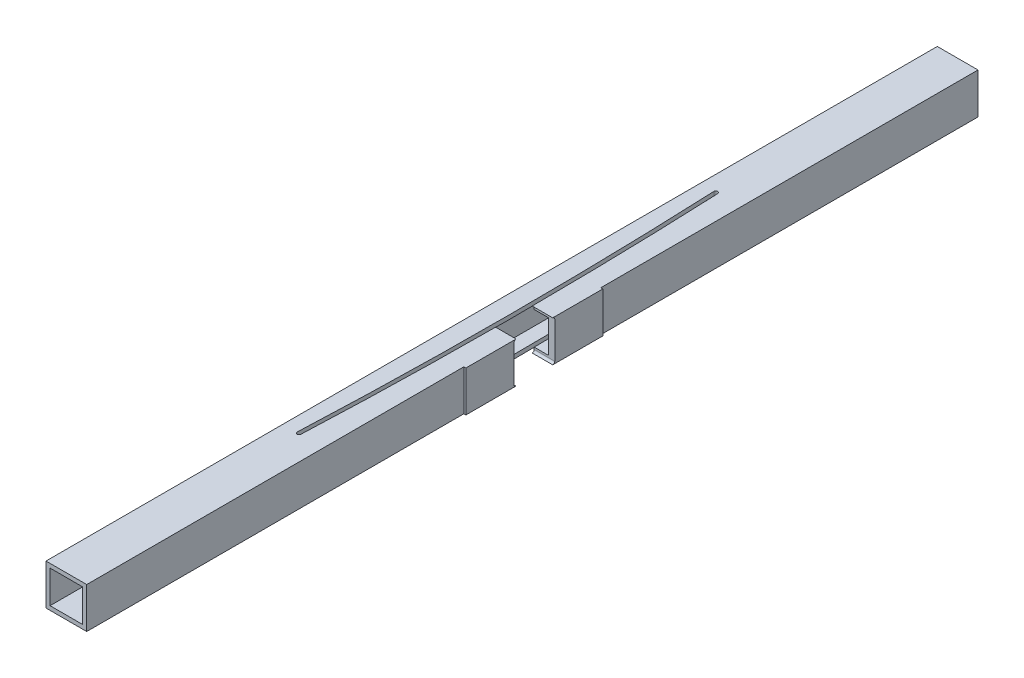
ISO-10303-21;
HEADER;
FILE_DESCRIPTION(('STEP AP214'),'2;1');
FILE_NAME('part.step','',(''),(''),'','','');
FILE_SCHEMA(('AUTOMOTIVE_DESIGN { 1 0 10303 214 1 1 1 1 }'));
ENDSEC;
DATA;
#1=APPLICATION_CONTEXT('core data for automotive mechanical design processes');
#2=APPLICATION_PROTOCOL_DEFINITION('international standard','automotive_design',2000,#1);
#3=PRODUCT_CONTEXT('',#1,'mechanical');
#4=PRODUCT('Part','Part','',(#3));
#5=PRODUCT_RELATED_PRODUCT_CATEGORY('part','',(#4));
#6=PRODUCT_DEFINITION_FORMATION('','',#4);
#7=PRODUCT_DEFINITION_CONTEXT('part definition',#1,'design');
#8=PRODUCT_DEFINITION('design','',#6,#7);
#9=PRODUCT_DEFINITION_SHAPE('','',#8);
#10=(LENGTH_UNIT() NAMED_UNIT(*) SI_UNIT(.MILLI.,.METRE.));
#11=(NAMED_UNIT(*) PLANE_ANGLE_UNIT() SI_UNIT($,.RADIAN.));
#12=(NAMED_UNIT(*) SI_UNIT($,.STERADIAN.) SOLID_ANGLE_UNIT());
#13=UNCERTAINTY_MEASURE_WITH_UNIT(LENGTH_MEASURE(1.E-05),#10,'distance_accuracy_value','');
#14=(GEOMETRIC_REPRESENTATION_CONTEXT(3) GLOBAL_UNCERTAINTY_ASSIGNED_CONTEXT((#13)) GLOBAL_UNIT_ASSIGNED_CONTEXT((#10,
#11,#12)) REPRESENTATION_CONTEXT('',''));
#15=CARTESIAN_POINT('',(0.,0.,0.));
#16=DIRECTION('',(0.,0.,1.));
#17=DIRECTION('',(1.,0.,0.));
#18=AXIS2_PLACEMENT_3D('',#15,#16,#17);
#19=CARTESIAN_POINT('',(31.75,-31.75,695.));
#20=DIRECTION('',(-1.,0.,0.));
#21=DIRECTION('',(0.,-1.,0.));
#22=AXIS2_PLACEMENT_3D('',#19,#20,#21);
#23=PLANE('',#22);
#24=DIRECTION('',(0.,-1.,0.));
#25=VECTOR('',#24,1.);
#26=CARTESIAN_POINT('',(31.75,-31.75,106.75));
#27=LINE('',#26,#25);
#28=CARTESIAN_POINT('',(31.75,31.75,106.75));
#29=VERTEX_POINT('',#28);
#30=CARTESIAN_POINT('',(31.75,-31.75,106.75));
#31=VERTEX_POINT('',#30);
#32=EDGE_CURVE('E72',#29,#31,#27,.T.);
#33=ORIENTED_EDGE('',*,*,#32,.F.);
#34=DIRECTION('',(0.,0.,-1.));
#35=VECTOR('',#34,1.);
#36=CARTESIAN_POINT('',(31.75,31.75,695.));
#37=LINE('',#36,#35);
#38=CARTESIAN_POINT('',(31.75,31.75,695.));
#39=VERTEX_POINT('',#38);
#40=EDGE_CURVE('E460',#39,#29,#37,.T.);
#41=ORIENTED_EDGE('',*,*,#40,.F.);
#42=DIRECTION('',(0.,1.,0.));
#43=VECTOR('',#42,1.);
#44=CARTESIAN_POINT('',(31.75,-31.75,695.));
#45=LINE('',#44,#43);
#46=CARTESIAN_POINT('',(31.75,-31.75,695.));
#47=VERTEX_POINT('',#46);
#48=EDGE_CURVE('E557',#47,#39,#45,.T.);
#49=ORIENTED_EDGE('',*,*,#48,.F.);
#50=DIRECTION('',(0.,0.,-1.));
#51=VECTOR('',#50,1.);
#52=CARTESIAN_POINT('',(31.75,-31.75,695.));
#53=LINE('',#52,#51);
#54=EDGE_CURVE('E573',#47,#31,#53,.T.);
#55=ORIENTED_EDGE('',*,*,#54,.T.);
#56=EDGE_LOOP('',(#33,#41,#49,#55));
#57=FACE_BOUND('',#56,.T.);
#58=ADVANCED_FACE('F58',(#57),#23,.F.);
#59=CARTESIAN_POINT('',(31.75,31.75,-106.75));
#60=VERTEX_POINT('',#59);
#61=CARTESIAN_POINT('',(31.75,31.75,-695.));
#62=VERTEX_POINT('',#61);
#63=EDGE_CURVE('E455',#60,#62,#37,.T.);
#64=ORIENTED_EDGE('',*,*,#63,.F.);
#65=DIRECTION('',(0.,-1.,0.));
#66=VECTOR('',#65,1.);
#67=CARTESIAN_POINT('',(31.75,-31.75,-106.75));
#68=LINE('',#67,#66);
#69=CARTESIAN_POINT('',(31.75,-31.75,-106.75));
#70=VERTEX_POINT('',#69);
#71=EDGE_CURVE('E278',#60,#70,#68,.T.);
#72=ORIENTED_EDGE('',*,*,#71,.T.);
#73=CARTESIAN_POINT('',(31.75,-31.75,-695.));
#74=VERTEX_POINT('',#73);
#75=EDGE_CURVE('E274',#70,#74,#53,.T.);
#76=ORIENTED_EDGE('',*,*,#75,.T.);
#77=DIRECTION('',(0.,1.,0.));
#78=VECTOR('',#77,1.);
#79=CARTESIAN_POINT('',(31.75,-31.75,-695.));
#80=LINE('',#79,#78);
#81=EDGE_CURVE('E457',#74,#62,#80,.T.);
#82=ORIENTED_EDGE('',*,*,#81,.T.);
#83=EDGE_LOOP('',(#64,#72,#76,#82));
#84=FACE_BOUND('',#83,.T.);
#85=ADVANCED_FACE('F442',(#84),#23,.F.);
#86=CARTESIAN_POINT('',(-31.75,-31.75,695.));
#87=DIRECTION('',(0.,1.,0.));
#88=DIRECTION('',(0.,0.,1.));
#89=AXIS2_PLACEMENT_3D('',#86,#87,#88);
#90=PLANE('',#89);
#91=CARTESIAN_POINT('',(19.925,-31.75,50.));
#92=DIRECTION('',(0.,-1.,0.));
#93=DIRECTION('',(0.,0.,-1.));
#94=AXIS2_PLACEMENT_3D('',#91,#92,#93);
#95=CIRCLE('',#94,3.175);
#96=CARTESIAN_POINT('',(19.925,-31.75,46.825));
#97=VERTEX_POINT('',#96);
#98=EDGE_CURVE('E1006',#97,#97,#95,.T.);
#99=ORIENTED_EDGE('',*,*,#98,.F.);
#100=EDGE_LOOP('',(#99));
#101=FACE_BOUND('',#100,.T.);
#102=ORIENTED_EDGE('',*,*,#75,.F.);
#103=DIRECTION('',(-1.,0.,0.));
#104=VECTOR('',#103,1.);
#105=CARTESIAN_POINT('',(34.925,-31.75,-106.75));
#106=LINE('',#105,#104);
#107=CARTESIAN_POINT('',(34.925,-31.75,-106.75));
#108=VERTEX_POINT('',#107);
#109=EDGE_CURVE('E267',#108,#70,#106,.T.);
#110=ORIENTED_EDGE('',*,*,#109,.F.);
#111=DIRECTION('',(0.,0.,1.));
#112=VECTOR('',#111,1.);
#113=CARTESIAN_POINT('',(34.925,-31.75,-28.575));
#114=LINE('',#113,#112);
#115=CARTESIAN_POINT('',(34.925,-31.75,-28.575));
#116=VERTEX_POINT('',#115);
#117=EDGE_CURVE('E271',#108,#116,#114,.T.);
#118=ORIENTED_EDGE('',*,*,#117,.T.);
#119=DIRECTION('',(1.,0.,0.));
#120=VECTOR('',#119,1.);
#121=CARTESIAN_POINT('',(0.800000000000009,-31.75,-28.575));
#122=LINE('',#121,#120);
#123=CARTESIAN_POINT('',(2.94439046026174,-31.7500000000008,-28.575));
#124=VERTEX_POINT('',#123);
#125=EDGE_CURVE('E499',#124,#116,#122,.T.);
#126=ORIENTED_EDGE('',*,*,#125,.F.);
#127=CARTESIAN_POINT('',(-7338.66944444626,-31.75,0.));
#128=DIRECTION('',(0.,1.,0.));
#129=DIRECTION('',(0.,0.,1.));
#130=AXIS2_PLACEMENT_3D('',#127,#128,#129);
#131=CIRCLE('',#130,7341.66944444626);
#132=CARTESIAN_POINT('',(-4.20294331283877,-31.75,-325.132857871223));
#133=VERTEX_POINT('',#132);
#134=EDGE_CURVE('E346',#124,#133,#131,.T.);
#135=ORIENTED_EDGE('',*,*,#134,.T.);
#136=CARTESIAN_POINT('',(-7.19999999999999,-31.75,-325.));
#137=DIRECTION('',(0.,1.,0.));
#138=DIRECTION('',(0.,0.,1.));
#139=AXIS2_PLACEMENT_3D('',#136,#137,#138);
#140=CIRCLE('',#139,3.00000000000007);
#141=CARTESIAN_POINT('',(-10.1970566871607,-31.75,-324.867142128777));
#142=VERTEX_POINT('',#141);
#143=EDGE_CURVE('E350',#133,#142,#140,.T.);
#144=ORIENTED_EDGE('',*,*,#143,.T.);
#145=CARTESIAN_POINT('',(-7338.66944444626,-31.75,0.));
#146=DIRECTION('',(0.,-1.,0.));
#147=DIRECTION('',(0.,0.,1.));
#148=AXIS2_PLACEMENT_3D('',#145,#146,#147);
#149=CIRCLE('',#148,7335.66944444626);
#150=CARTESIAN_POINT('',(-10.1970566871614,-31.75,324.867142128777));
#151=VERTEX_POINT('',#150);
#152=EDGE_CURVE('E353',#142,#151,#149,.T.);
#153=ORIENTED_EDGE('',*,*,#152,.T.);
#154=CARTESIAN_POINT('',(-7.19999999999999,-31.75,325.));
#155=DIRECTION('',(0.,1.,0.));
#156=DIRECTION('',(0.,0.,1.));
#157=AXIS2_PLACEMENT_3D('',#154,#155,#156);
#158=CIRCLE('',#157,3.00000000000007);
#159=CARTESIAN_POINT('',(-4.20294331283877,-31.75,325.132857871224));
#160=VERTEX_POINT('',#159);
#161=EDGE_CURVE('E343',#151,#160,#158,.T.);
#162=ORIENTED_EDGE('',*,*,#161,.T.);
#163=CARTESIAN_POINT('',(2.94439046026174,-31.7500000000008,28.575));
#164=VERTEX_POINT('',#163);
#165=EDGE_CURVE('E347',#160,#164,#131,.T.);
#166=ORIENTED_EDGE('',*,*,#165,.T.);
#167=DIRECTION('',(1.,0.,0.));
#168=VECTOR('',#167,1.);
#169=CARTESIAN_POINT('',(0.800000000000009,-31.75,28.575));
#170=LINE('',#169,#168);
#171=CARTESIAN_POINT('',(34.925,-31.75,28.575));
#172=VERTEX_POINT('',#171);
#173=EDGE_CURVE('E503',#164,#172,#170,.T.);
#174=ORIENTED_EDGE('',*,*,#173,.T.);
#175=DIRECTION('',(0.,0.,-1.));
#176=VECTOR('',#175,1.);
#177=CARTESIAN_POINT('',(34.925,-31.75,28.575));
#178=LINE('',#177,#176);
#179=CARTESIAN_POINT('',(34.925,-31.75,106.75));
#180=VERTEX_POINT('',#179);
#181=EDGE_CURVE('E308',#180,#172,#178,.T.);
#182=ORIENTED_EDGE('',*,*,#181,.F.);
#183=DIRECTION('',(-1.,0.,0.));
#184=VECTOR('',#183,1.);
#185=CARTESIAN_POINT('',(34.925,-31.75,106.75));
#186=LINE('',#185,#184);
#187=EDGE_CURVE('E324',#180,#31,#186,.T.);
#188=ORIENTED_EDGE('',*,*,#187,.T.);
#189=ORIENTED_EDGE('',*,*,#54,.F.);
#190=DIRECTION('',(1.,0.,0.));
#191=VECTOR('',#190,1.);
#192=CARTESIAN_POINT('',(-31.75,-31.75,695.));
#193=LINE('',#192,#191);
#194=CARTESIAN_POINT('',(-31.75,-31.75,695.));
#195=VERTEX_POINT('',#194);
#196=EDGE_CURVE('E565',#195,#47,#193,.T.);
#197=ORIENTED_EDGE('',*,*,#196,.F.);
#198=DIRECTION('',(0.,0.,-1.));
#199=VECTOR('',#198,1.);
#200=CARTESIAN_POINT('',(-31.75,-31.75,695.));
#201=LINE('',#200,#199);
#202=CARTESIAN_POINT('',(-31.75,-31.75,-695.));
#203=VERTEX_POINT('',#202);
#204=EDGE_CURVE('E465',#195,#203,#201,.T.);
#205=ORIENTED_EDGE('',*,*,#204,.T.);
#206=DIRECTION('',(1.,0.,0.));
#207=VECTOR('',#206,1.);
#208=CARTESIAN_POINT('',(-31.75,-31.75,-695.));
#209=LINE('',#208,#207);
#210=EDGE_CURVE('E561',#203,#74,#209,.T.);
#211=ORIENTED_EDGE('',*,*,#210,.T.);
#212=EDGE_LOOP('',(#102,#110,#118,#126,#135,#144,#153,#162,#166,#174,#182,#188,#189,#197,#205,#211));
#213=FACE_BOUND('',#212,.T.);
#214=ADVANCED_FACE('F269',(#101,#213),#90,.F.);
#215=CARTESIAN_POINT('',(25.4,-25.4,695.));
#216=DIRECTION('',(-1.,0.,0.));
#217=DIRECTION('',(0.,0.,1.));
#218=AXIS2_PLACEMENT_3D('',#215,#216,#217);
#219=PLANE('',#218);
#220=DIRECTION('',(0.,-1.,0.));
#221=VECTOR('',#220,1.);
#222=CARTESIAN_POINT('',(25.4,-25.4,-31.7500000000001));
#223=LINE('',#222,#221);
#224=CARTESIAN_POINT('',(25.4,25.4,-31.7500000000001));
#225=VERTEX_POINT('',#224);
#226=CARTESIAN_POINT('',(25.4,-25.4,-31.7500000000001));
#227=VERTEX_POINT('',#226);
#228=EDGE_CURVE('E521',#225,#227,#223,.T.);
#229=ORIENTED_EDGE('',*,*,#228,.F.);
#230=DIRECTION('',(0.,0.,-1.));
#231=VECTOR('',#230,1.);
#232=CARTESIAN_POINT('',(25.4,25.4,695.));
#233=LINE('',#232,#231);
#234=CARTESIAN_POINT('',(25.4,25.4,-695.));
#235=VERTEX_POINT('',#234);
#236=EDGE_CURVE('E553',#225,#235,#233,.T.);
#237=ORIENTED_EDGE('',*,*,#236,.T.);
#238=DIRECTION('',(0.,1.,0.));
#239=VECTOR('',#238,1.);
#240=CARTESIAN_POINT('',(25.4,-25.4,-695.));
#241=LINE('',#240,#239);
#242=CARTESIAN_POINT('',(25.4,-25.4,-695.));
#243=VERTEX_POINT('',#242);
#244=EDGE_CURVE('E525',#243,#235,#241,.T.);
#245=ORIENTED_EDGE('',*,*,#244,.F.);
#246=DIRECTION('',(0.,0.,-1.));
#247=VECTOR('',#246,1.);
#248=CARTESIAN_POINT('',(25.4,-25.4,695.));
#249=LINE('',#248,#247);
#250=EDGE_CURVE('E536',#227,#243,#249,.T.);
#251=ORIENTED_EDGE('',*,*,#250,.F.);
#252=EDGE_LOOP('',(#229,#237,#245,#251));
#253=FACE_BOUND('',#252,.T.);
#254=ADVANCED_FACE('F450',(#253),#219,.T.);
#255=CARTESIAN_POINT('',(0.,0.,695.));
#256=DIRECTION('',(0.,0.,-1.));
#257=DIRECTION('',(-1.,0.,0.));
#258=AXIS2_PLACEMENT_3D('',#255,#256,#257);
#259=PLANE('',#258);
#260=ORIENTED_EDGE('',*,*,#48,.T.);
#261=DIRECTION('',(-1.,0.,0.));
#262=VECTOR('',#261,1.);
#263=CARTESIAN_POINT('',(-31.75,31.75,695.));
#264=LINE('',#263,#262);
#265=CARTESIAN_POINT('',(-31.75,31.75,695.));
#266=VERTEX_POINT('',#265);
#267=EDGE_CURVE('E560',#39,#266,#264,.T.);
#268=ORIENTED_EDGE('',*,*,#267,.T.);
#269=DIRECTION('',(0.,-1.,0.));
#270=VECTOR('',#269,1.);
#271=CARTESIAN_POINT('',(-31.75,-31.75,695.));
#272=LINE('',#271,#270);
#273=EDGE_CURVE('E563',#266,#195,#272,.T.);
#274=ORIENTED_EDGE('',*,*,#273,.T.);
#275=ORIENTED_EDGE('',*,*,#196,.T.);
#276=EDGE_LOOP('',(#260,#268,#274,#275));
#277=FACE_BOUND('',#276,.T.);
#278=DIRECTION('',(0.,1.,0.));
#279=VECTOR('',#278,1.);
#280=CARTESIAN_POINT('',(25.4,-25.4,695.));
#281=LINE('',#280,#279);
#282=CARTESIAN_POINT('',(25.4,-25.4,695.));
#283=VERTEX_POINT('',#282);
#284=CARTESIAN_POINT('',(25.4,25.4,695.));
#285=VERTEX_POINT('',#284);
#286=EDGE_CURVE('E526',#283,#285,#281,.T.);
#287=ORIENTED_EDGE('',*,*,#286,.F.);
#288=DIRECTION('',(1.,0.,0.));
#289=VECTOR('',#288,1.);
#290=CARTESIAN_POINT('',(-25.4,-25.4,695.));
#291=LINE('',#290,#289);
#292=CARTESIAN_POINT('',(-25.4,-25.4,695.));
#293=VERTEX_POINT('',#292);
#294=EDGE_CURVE('E534',#293,#283,#291,.T.);
#295=ORIENTED_EDGE('',*,*,#294,.F.);
#296=DIRECTION('',(0.,-1.,0.));
#297=VECTOR('',#296,1.);
#298=CARTESIAN_POINT('',(-25.4,-25.4,695.));
#299=LINE('',#298,#297);
#300=CARTESIAN_POINT('',(-25.4,25.4,695.));
#301=VERTEX_POINT('',#300);
#302=EDGE_CURVE('E531',#301,#293,#299,.T.);
#303=ORIENTED_EDGE('',*,*,#302,.F.);
#304=DIRECTION('',(-1.,0.,0.));
#305=VECTOR('',#304,1.);
#306=CARTESIAN_POINT('',(-25.4,25.4,695.));
#307=LINE('',#306,#305);
#308=EDGE_CURVE('E528',#285,#301,#307,.T.);
#309=ORIENTED_EDGE('',*,*,#308,.F.);
#310=EDGE_LOOP('',(#287,#295,#303,#309));
#311=FACE_BOUND('',#310,.T.);
#312=ADVANCED_FACE('F589',(#277,#311),#259,.F.);
#313=CARTESIAN_POINT('',(0.,0.,-695.));
#314=DIRECTION('',(0.,0.,-1.));
#315=DIRECTION('',(-1.,0.,0.));
#316=AXIS2_PLACEMENT_3D('',#313,#314,#315);
#317=PLANE('',#316);
#318=ORIENTED_EDGE('',*,*,#81,.F.);
#319=ORIENTED_EDGE('',*,*,#210,.F.);
#320=DIRECTION('',(0.,-1.,0.));
#321=VECTOR('',#320,1.);
#322=CARTESIAN_POINT('',(-31.75,-31.75,-695.));
#323=LINE('',#322,#321);
#324=CARTESIAN_POINT('',(-31.75,31.75,-695.));
#325=VERTEX_POINT('',#324);
#326=EDGE_CURVE('E570',#325,#203,#323,.T.);
#327=ORIENTED_EDGE('',*,*,#326,.F.);
#328=DIRECTION('',(-1.,0.,0.));
#329=VECTOR('',#328,1.);
#330=CARTESIAN_POINT('',(-31.75,31.75,-695.));
#331=LINE('',#330,#329);
#332=EDGE_CURVE('E568',#62,#325,#331,.T.);
#333=ORIENTED_EDGE('',*,*,#332,.F.);
#334=EDGE_LOOP('',(#318,#319,#327,#333));
#335=FACE_BOUND('',#334,.T.);
#336=DIRECTION('',(1.,0.,0.));
#337=VECTOR('',#336,1.);
#338=CARTESIAN_POINT('',(-25.4,-25.4,-695.));
#339=LINE('',#338,#337);
#340=CARTESIAN_POINT('',(-25.4,-25.4,-695.));
#341=VERTEX_POINT('',#340);
#342=EDGE_CURVE('E529',#341,#243,#339,.T.);
#343=ORIENTED_EDGE('',*,*,#342,.T.);
#344=ORIENTED_EDGE('',*,*,#244,.T.);
#345=DIRECTION('',(-1.,0.,0.));
#346=VECTOR('',#345,1.);
#347=CARTESIAN_POINT('',(-25.4,25.4,-695.));
#348=LINE('',#347,#346);
#349=CARTESIAN_POINT('',(-25.4,25.4,-695.));
#350=VERTEX_POINT('',#349);
#351=EDGE_CURVE('E539',#235,#350,#348,.T.);
#352=ORIENTED_EDGE('',*,*,#351,.T.);
#353=DIRECTION('',(0.,-1.,0.));
#354=VECTOR('',#353,1.);
#355=CARTESIAN_POINT('',(-25.4,-25.4,-695.));
#356=LINE('',#355,#354);
#357=EDGE_CURVE('E542',#350,#341,#356,.T.);
#358=ORIENTED_EDGE('',*,*,#357,.T.);
#359=EDGE_LOOP('',(#343,#344,#352,#358));
#360=FACE_BOUND('',#359,.T.);
#361=ADVANCED_FACE('F583',(#335,#360),#317,.T.);
#362=CARTESIAN_POINT('',(-31.75,31.75,695.));
#363=DIRECTION('',(0.,-1.,0.));
#364=DIRECTION('',(0.,0.,-1.));
#365=AXIS2_PLACEMENT_3D('',#362,#363,#364);
#366=PLANE('',#365);
#367=DIRECTION('',(1.,0.,0.));
#368=VECTOR('',#367,1.);
#369=CARTESIAN_POINT('',(0.800000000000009,31.75,-28.575));
#370=LINE('',#369,#368);
#371=CARTESIAN_POINT('',(2.94439046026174,31.7499999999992,-28.575));
#372=VERTEX_POINT('',#371);
#373=CARTESIAN_POINT('',(34.925,31.75,-28.575));
#374=VERTEX_POINT('',#373);
#375=EDGE_CURVE('E514',#372,#374,#370,.T.);
#376=ORIENTED_EDGE('',*,*,#375,.T.);
#377=DIRECTION('',(0.,0.,-1.));
#378=VECTOR('',#377,1.);
#379=CARTESIAN_POINT('',(34.925,31.75,-106.75));
#380=LINE('',#379,#378);
#381=CARTESIAN_POINT('',(34.925,31.75,-106.75));
#382=VERTEX_POINT('',#381);
#383=EDGE_CURVE('E294',#374,#382,#380,.T.);
#384=ORIENTED_EDGE('',*,*,#383,.T.);
#385=DIRECTION('',(-1.,0.,0.));
#386=VECTOR('',#385,1.);
#387=CARTESIAN_POINT('',(34.925,31.75,-106.75));
#388=LINE('',#387,#386);
#389=EDGE_CURVE('E279',#382,#60,#388,.T.);
#390=ORIENTED_EDGE('',*,*,#389,.T.);
#391=ORIENTED_EDGE('',*,*,#63,.T.);
#392=ORIENTED_EDGE('',*,*,#332,.T.);
#393=DIRECTION('',(0.,0.,-1.));
#394=VECTOR('',#393,1.);
#395=CARTESIAN_POINT('',(-31.75,31.75,695.));
#396=LINE('',#395,#394);
#397=EDGE_CURVE('E461',#266,#325,#396,.T.);
#398=ORIENTED_EDGE('',*,*,#397,.F.);
#399=ORIENTED_EDGE('',*,*,#267,.F.);
#400=ORIENTED_EDGE('',*,*,#40,.T.);
#401=DIRECTION('',(-1.,0.,0.));
#402=VECTOR('',#401,1.);
#403=CARTESIAN_POINT('',(34.925,31.75,106.75));
#404=LINE('',#403,#402);
#405=CARTESIAN_POINT('',(34.925,31.75,106.75));
#406=VERTEX_POINT('',#405);
#407=EDGE_CURVE('E327',#406,#29,#404,.T.);
#408=ORIENTED_EDGE('',*,*,#407,.F.);
#409=DIRECTION('',(0.,0.,1.));
#410=VECTOR('',#409,1.);
#411=CARTESIAN_POINT('',(34.925,31.75,106.75));
#412=LINE('',#411,#410);
#413=CARTESIAN_POINT('',(34.925,31.75,28.575));
#414=VERTEX_POINT('',#413);
#415=EDGE_CURVE('E320',#414,#406,#412,.T.);
#416=ORIENTED_EDGE('',*,*,#415,.F.);
#417=DIRECTION('',(1.,0.,0.));
#418=VECTOR('',#417,1.);
#419=CARTESIAN_POINT('',(0.800000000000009,31.75,28.575));
#420=LINE('',#419,#418);
#421=CARTESIAN_POINT('',(2.94439046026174,31.75,28.575));
#422=VERTEX_POINT('',#421);
#423=EDGE_CURVE('E512',#422,#414,#420,.T.);
#424=ORIENTED_EDGE('',*,*,#423,.F.);
#425=CARTESIAN_POINT('',(-7338.66944444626,31.75,0.));
#426=DIRECTION('',(0.,1.,0.));
#427=DIRECTION('',(0.,0.,1.));
#428=AXIS2_PLACEMENT_3D('',#425,#426,#427);
#429=CIRCLE('',#428,7341.66944444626);
#430=CARTESIAN_POINT('',(-4.20294331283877,31.75,325.132857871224));
#431=VERTEX_POINT('',#430);
#432=EDGE_CURVE('E335',#431,#422,#429,.T.);
#433=ORIENTED_EDGE('',*,*,#432,.F.);
#434=CARTESIAN_POINT('',(-7.19999999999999,31.75,325.));
#435=DIRECTION('',(0.,1.,0.));
#436=DIRECTION('',(0.,0.,1.));
#437=AXIS2_PLACEMENT_3D('',#434,#435,#436);
#438=CIRCLE('',#437,3.00000000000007);
#439=CARTESIAN_POINT('',(-10.1970566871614,31.75,324.867142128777));
#440=VERTEX_POINT('',#439);
#441=EDGE_CURVE('E331',#440,#431,#438,.T.);
#442=ORIENTED_EDGE('',*,*,#441,.F.);
#443=CARTESIAN_POINT('',(-7338.66944444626,31.75,0.));
#444=DIRECTION('',(0.,-1.,0.));
#445=DIRECTION('',(0.,0.,1.));
#446=AXIS2_PLACEMENT_3D('',#443,#444,#445);
#447=CIRCLE('',#446,7335.66944444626);
#448=CARTESIAN_POINT('',(-10.1970566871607,31.75,-324.867142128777));
#449=VERTEX_POINT('',#448);
#450=EDGE_CURVE('E340',#449,#440,#447,.T.);
#451=ORIENTED_EDGE('',*,*,#450,.F.);
#452=CARTESIAN_POINT('',(-7.19999999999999,31.75,-325.));
#453=DIRECTION('',(0.,1.,0.));
#454=DIRECTION('',(0.,0.,1.));
#455=AXIS2_PLACEMENT_3D('',#452,#453,#454);
#456=CIRCLE('',#455,3.00000000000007);
#457=CARTESIAN_POINT('',(-4.20294331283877,31.75,-325.132857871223));
#458=VERTEX_POINT('',#457);
#459=EDGE_CURVE('E337',#458,#449,#456,.T.);
#460=ORIENTED_EDGE('',*,*,#459,.F.);
#461=EDGE_CURVE('E334',#372,#458,#429,.T.);
#462=ORIENTED_EDGE('',*,*,#461,.F.);
#463=EDGE_LOOP('',(#376,#384,#390,#391,#392,#398,#399,#400,#408,#416,#424,#433,#442,#451,#460,#462));
#464=FACE_BOUND('',#463,.T.);
#465=ADVANCED_FACE('F586',(#464),#366,.F.);
#466=CARTESIAN_POINT('',(-31.75,-31.75,695.));
#467=DIRECTION('',(1.,0.,0.));
#468=DIRECTION('',(0.,1.,0.));
#469=AXIS2_PLACEMENT_3D('',#466,#467,#468);
#470=PLANE('',#469);
#471=ORIENTED_EDGE('',*,*,#326,.T.);
#472=ORIENTED_EDGE('',*,*,#204,.F.);
#473=ORIENTED_EDGE('',*,*,#273,.F.);
#474=ORIENTED_EDGE('',*,*,#397,.T.);
#475=EDGE_LOOP('',(#471,#472,#473,#474));
#476=FACE_BOUND('',#475,.T.);
#477=ADVANCED_FACE('F587',(#476),#470,.F.);
#478=DIRECTION('',(0.,1.,0.));
#479=VECTOR('',#478,1.);
#480=CARTESIAN_POINT('',(25.4,-25.3999999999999,31.7500000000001));
#481=LINE('',#480,#479);
#482=CARTESIAN_POINT('',(25.4,-25.4,31.7500000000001));
#483=VERTEX_POINT('',#482);
#484=CARTESIAN_POINT('',(25.4,25.4,31.7500000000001));
#485=VERTEX_POINT('',#484);
#486=EDGE_CURVE('E501',#483,#485,#481,.T.);
#487=ORIENTED_EDGE('',*,*,#486,.F.);
#488=EDGE_CURVE('E547',#283,#483,#249,.T.);
#489=ORIENTED_EDGE('',*,*,#488,.F.);
#490=ORIENTED_EDGE('',*,*,#286,.T.);
#491=EDGE_CURVE('E554',#285,#485,#233,.T.);
#492=ORIENTED_EDGE('',*,*,#491,.T.);
#493=EDGE_LOOP('',(#487,#489,#490,#492));
#494=FACE_BOUND('',#493,.T.);
#495=ADVANCED_FACE('F634',(#494),#219,.T.);
#496=CARTESIAN_POINT('',(-25.4,25.4,695.));
#497=DIRECTION('',(0.,-1.,0.));
#498=DIRECTION('',(0.,0.,-1.));
#499=AXIS2_PLACEMENT_3D('',#496,#497,#498);
#500=PLANE('',#499);
#501=CARTESIAN_POINT('',(-7338.66944444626,25.4,0.));
#502=DIRECTION('',(0.,-1.,0.));
#503=DIRECTION('',(0.,0.,-1.));
#504=AXIS2_PLACEMENT_3D('',#501,#502,#503);
#505=CIRCLE('',#504,7341.66944444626);
#506=CARTESIAN_POINT('',(-4.20294331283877,25.4,-325.132857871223));
#507=VERTEX_POINT('',#506);
#508=CARTESIAN_POINT('',(2.93134618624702,25.4,-31.75));
#509=VERTEX_POINT('',#508);
#510=EDGE_CURVE('E377',#507,#509,#505,.T.);
#511=ORIENTED_EDGE('',*,*,#510,.F.);
#512=CARTESIAN_POINT('',(-7.19999999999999,25.4,-325.));
#513=DIRECTION('',(0.,-1.,0.));
#514=DIRECTION('',(0.,0.,-1.));
#515=AXIS2_PLACEMENT_3D('',#512,#513,#514);
#516=CIRCLE('',#515,3.00000000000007);
#517=CARTESIAN_POINT('',(-10.1970566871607,25.4,-324.867142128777));
#518=VERTEX_POINT('',#517);
#519=EDGE_CURVE('E656',#518,#507,#516,.T.);
#520=ORIENTED_EDGE('',*,*,#519,.F.);
#521=CARTESIAN_POINT('',(-7338.66944444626,25.4,0.));
#522=DIRECTION('',(0.,-1.,0.));
#523=DIRECTION('',(0.,0.,-1.));
#524=AXIS2_PLACEMENT_3D('',#521,#522,#523);
#525=CIRCLE('',#524,7335.66944444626);
#526=CARTESIAN_POINT('',(-10.1970566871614,25.4,324.867142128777));
#527=VERTEX_POINT('',#526);
#528=EDGE_CURVE('E650',#527,#518,#525,.F.);
#529=ORIENTED_EDGE('',*,*,#528,.F.);
#530=CARTESIAN_POINT('',(-7.19999999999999,25.4,325.));
#531=DIRECTION('',(0.,-1.,0.));
#532=DIRECTION('',(0.,0.,-1.));
#533=AXIS2_PLACEMENT_3D('',#530,#531,#532);
#534=CIRCLE('',#533,3.00000000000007);
#535=CARTESIAN_POINT('',(-4.20294331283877,25.4,325.132857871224));
#536=VERTEX_POINT('',#535);
#537=EDGE_CURVE('E516',#536,#527,#534,.T.);
#538=ORIENTED_EDGE('',*,*,#537,.F.);
#539=CARTESIAN_POINT('',(2.93134618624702,25.4,31.75));
#540=VERTEX_POINT('',#539);
#541=EDGE_CURVE('E374',#540,#536,#505,.T.);
#542=ORIENTED_EDGE('',*,*,#541,.F.);
#543=DIRECTION('',(-1.,0.,0.));
#544=VECTOR('',#543,1.);
#545=CARTESIAN_POINT('',(-25.4,25.4,31.7500000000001));
#546=LINE('',#545,#544);
#547=EDGE_CURVE('E518',#485,#540,#546,.T.);
#548=ORIENTED_EDGE('',*,*,#547,.F.);
#549=ORIENTED_EDGE('',*,*,#491,.F.);
#550=ORIENTED_EDGE('',*,*,#308,.T.);
#551=DIRECTION('',(0.,0.,-1.));
#552=VECTOR('',#551,1.);
#553=CARTESIAN_POINT('',(-25.4,25.4,695.));
#554=LINE('',#553,#552);
#555=EDGE_CURVE('E551',#301,#350,#554,.T.);
#556=ORIENTED_EDGE('',*,*,#555,.T.);
#557=ORIENTED_EDGE('',*,*,#351,.F.);
#558=ORIENTED_EDGE('',*,*,#236,.F.);
#559=DIRECTION('',(1.,0.,0.));
#560=VECTOR('',#559,1.);
#561=CARTESIAN_POINT('',(-25.4,25.4,-31.7500000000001));
#562=LINE('',#561,#560);
#563=EDGE_CURVE('E523',#509,#225,#562,.T.);
#564=ORIENTED_EDGE('',*,*,#563,.F.);
#565=EDGE_LOOP('',(#511,#520,#529,#538,#542,#548,#549,#550,#556,#557,#558,#564));
#566=FACE_BOUND('',#565,.T.);
#567=ADVANCED_FACE('F638',(#566),#500,.T.);
#568=CARTESIAN_POINT('',(-25.4,-25.4,695.));
#569=DIRECTION('',(1.,0.,0.));
#570=DIRECTION('',(0.,0.,-1.));
#571=AXIS2_PLACEMENT_3D('',#568,#569,#570);
#572=PLANE('',#571);
#573=ORIENTED_EDGE('',*,*,#357,.F.);
#574=ORIENTED_EDGE('',*,*,#555,.F.);
#575=ORIENTED_EDGE('',*,*,#302,.T.);
#576=DIRECTION('',(0.,0.,-1.));
#577=VECTOR('',#576,1.);
#578=CARTESIAN_POINT('',(-25.4,-25.4,695.));
#579=LINE('',#578,#577);
#580=EDGE_CURVE('E549',#293,#341,#579,.T.);
#581=ORIENTED_EDGE('',*,*,#580,.T.);
#582=EDGE_LOOP('',(#573,#574,#575,#581));
#583=FACE_BOUND('',#582,.T.);
#584=ADVANCED_FACE('F629',(#583),#572,.T.);
#585=CARTESIAN_POINT('',(-25.4,-25.4,695.));
#586=DIRECTION('',(0.,1.,0.));
#587=DIRECTION('',(-1.,0.,0.));
#588=AXIS2_PLACEMENT_3D('',#585,#586,#587);
#589=PLANE('',#588);
#590=CARTESIAN_POINT('',(19.925,-25.4,50.));
#591=DIRECTION('',(0.,1.,0.));
#592=DIRECTION('',(-1.,0.,0.));
#593=AXIS2_PLACEMENT_3D('',#590,#591,#592);
#594=CIRCLE('',#593,3.175);
#595=CARTESIAN_POINT('',(16.75,-25.4,50.));
#596=VERTEX_POINT('',#595);
#597=EDGE_CURVE('E290',#596,#596,#594,.F.);
#598=ORIENTED_EDGE('',*,*,#597,.T.);
#599=EDGE_LOOP('',(#598));
#600=FACE_BOUND('',#599,.T.);
#601=CARTESIAN_POINT('',(-7338.66944444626,-25.3999999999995,0.));
#602=DIRECTION('',(0.,1.,0.));
#603=DIRECTION('',(-1.,0.,0.));
#604=AXIS2_PLACEMENT_3D('',#601,#602,#603);
#605=CIRCLE('',#604,7341.66944444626);
#606=CARTESIAN_POINT('',(-4.20294331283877,-25.399999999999,325.132857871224));
#607=VERTEX_POINT('',#606);
#608=CARTESIAN_POINT('',(2.93134618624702,-25.4,31.7500000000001));
#609=VERTEX_POINT('',#608);
#610=EDGE_CURVE('E80',#607,#609,#605,.T.);
#611=ORIENTED_EDGE('',*,*,#610,.F.);
#612=CARTESIAN_POINT('',(-7.19999999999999,-25.4,325.));
#613=DIRECTION('',(0.,1.,0.));
#614=DIRECTION('',(-1.,0.,0.));
#615=AXIS2_PLACEMENT_3D('',#612,#613,#614);
#616=CIRCLE('',#615,3.00000000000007);
#617=CARTESIAN_POINT('',(-10.1970566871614,-25.399999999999,324.867142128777));
#618=VERTEX_POINT('',#617);
#619=EDGE_CURVE('E13',#618,#607,#616,.T.);
#620=ORIENTED_EDGE('',*,*,#619,.F.);
#621=CARTESIAN_POINT('',(-7338.66944444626,-25.3999999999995,0.));
#622=DIRECTION('',(0.,1.,0.));
#623=DIRECTION('',(-1.,0.,0.));
#624=AXIS2_PLACEMENT_3D('',#621,#622,#623);
#625=CIRCLE('',#624,7335.66944444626);
#626=CARTESIAN_POINT('',(-10.1970566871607,-25.4,-324.867142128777));
#627=VERTEX_POINT('',#626);
#628=EDGE_CURVE('E65',#627,#618,#625,.F.);
#629=ORIENTED_EDGE('',*,*,#628,.F.);
#630=CARTESIAN_POINT('',(-7.19999999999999,-25.4,-325.));
#631=DIRECTION('',(0.,1.,0.));
#632=DIRECTION('',(-1.,0.,0.));
#633=AXIS2_PLACEMENT_3D('',#630,#631,#632);
#634=CIRCLE('',#633,3.00000000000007);
#635=CARTESIAN_POINT('',(-4.20294331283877,-25.399999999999,-325.132857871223));
#636=VERTEX_POINT('',#635);
#637=EDGE_CURVE('E474',#636,#627,#634,.T.);
#638=ORIENTED_EDGE('',*,*,#637,.F.);
#639=CARTESIAN_POINT('',(2.93134618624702,-25.4,-31.75));
#640=VERTEX_POINT('',#639);
#641=EDGE_CURVE('E490',#640,#636,#605,.T.);
#642=ORIENTED_EDGE('',*,*,#641,.F.);
#643=DIRECTION('',(-1.,0.,0.));
#644=VECTOR('',#643,1.);
#645=CARTESIAN_POINT('',(-25.4,-25.4,-31.7500000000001));
#646=LINE('',#645,#644);
#647=EDGE_CURVE('E469',#227,#640,#646,.T.);
#648=ORIENTED_EDGE('',*,*,#647,.F.);
#649=ORIENTED_EDGE('',*,*,#250,.T.);
#650=ORIENTED_EDGE('',*,*,#342,.F.);
#651=ORIENTED_EDGE('',*,*,#580,.F.);
#652=ORIENTED_EDGE('',*,*,#294,.T.);
#653=ORIENTED_EDGE('',*,*,#488,.T.);
#654=DIRECTION('',(1.,0.,0.));
#655=VECTOR('',#654,1.);
#656=CARTESIAN_POINT('',(-25.4,-25.4,31.7500000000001));
#657=LINE('',#656,#655);
#658=EDGE_CURVE('E463',#609,#483,#657,.T.);
#659=ORIENTED_EDGE('',*,*,#658,.F.);
#660=EDGE_LOOP('',(#611,#620,#629,#638,#642,#648,#649,#650,#651,#652,#653,#659));
#661=FACE_BOUND('',#660,.T.);
#662=ADVANCED_FACE('F438',(#600,#661),#589,.T.);
#663=CARTESIAN_POINT('',(0.800000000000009,28.575,-28.575));
#664=DIRECTION('',(1.,0.,0.));
#665=DIRECTION('',(0.,1.,0.));
#666=AXIS2_PLACEMENT_3D('',#663,#664,#665);
#667=CYLINDRICAL_SURFACE('',#666,3.17499999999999);
#668=CARTESIAN_POINT('',(34.925,28.575,-28.575));
#669=DIRECTION('',(1.,0.,0.));
#670=DIRECTION('',(0.,1.,0.));
#671=AXIS2_PLACEMENT_3D('',#668,#669,#670);
#672=CIRCLE('',#671,3.175);
#673=CARTESIAN_POINT('',(34.925,28.575,-31.75));
#674=VERTEX_POINT('',#673);
#675=EDGE_CURVE('E296',#674,#374,#672,.T.);
#676=ORIENTED_EDGE('',*,*,#675,.T.);
#677=ORIENTED_EDGE('',*,*,#375,.F.);
#678=CARTESIAN_POINT('',(2.94439046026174,31.75,-28.575));
#679=CARTESIAN_POINT('',(2.9440428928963,31.7500085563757,-28.6643025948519));
#680=CARTESIAN_POINT('',(2.94369368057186,31.7462323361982,-28.7536011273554));
#681=CARTESIAN_POINT('',(2.94299453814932,31.7311765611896,-28.9315592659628));
#682=CARTESIAN_POINT('',(2.94264460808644,31.7198973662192,-29.0202189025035));
#683=CARTESIAN_POINT('',(2.9419468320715,31.6899131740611,-29.1962106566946));
#684=CARTESIAN_POINT('',(2.94159898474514,31.6712137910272,-29.283543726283));
#685=CARTESIAN_POINT('',(2.94090786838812,31.6265408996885,-29.4563028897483));
#686=CARTESIAN_POINT('',(2.94056459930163,31.6005674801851,-29.5417290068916));
#687=CARTESIAN_POINT('',(2.93954528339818,31.5119459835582,-29.794322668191));
#688=CARTESIAN_POINT('',(2.93887944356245,31.4385843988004,-29.9578771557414));
#689=CARTESIAN_POINT('',(2.93759824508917,31.2654923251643,-30.2702280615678));
#690=CARTESIAN_POINT('',(2.93698287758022,31.1657664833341,-30.4190270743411));
#691=CARTESIAN_POINT('',(2.93582254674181,30.9427436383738,-30.6977950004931));
#692=CARTESIAN_POINT('',(2.9352775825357,30.8194469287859,-30.8277641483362));
#693=CARTESIAN_POINT('',(2.93427684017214,30.5527568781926,-31.0651774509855));
#694=CARTESIAN_POINT('',(2.93382107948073,30.4093596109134,-31.1726171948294));
#695=CARTESIAN_POINT('',(2.93301489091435,30.1065487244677,-31.3619125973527));
#696=CARTESIAN_POINT('',(2.93266448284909,29.9471321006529,-31.4437634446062));
#697=CARTESIAN_POINT('',(2.93208189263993,29.6168512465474,-31.5794966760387));
#698=CARTESIAN_POINT('',(2.93184964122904,29.4459937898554,-31.6333954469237));
#699=CARTESIAN_POINT('',(2.93156963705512,29.1575755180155,-31.6982994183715));
#700=CARTESIAN_POINT('',(2.93148592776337,29.0418291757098,-31.7176754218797));
#701=CARTESIAN_POINT('',(2.93137419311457,28.8090713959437,-31.7435240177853));
#702=CARTESIAN_POINT('',(2.93134608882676,28.6920619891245,-31.7500149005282));
#703=CARTESIAN_POINT('',(2.93134618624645,28.575,-31.75));
#704=B_SPLINE_CURVE_WITH_KNOTS('',3,(#678,#679,#680,#681,#682,#683,#684,#685,#686,#687,#688,
#689,#690,#691,#692,#693,#694,#695,#696,#697,#698,#699,#700,#701,#702,#703),.UNSPECIFIED.,.F.,
.F.,(4,2,2,2,2,2,2,2,2,2,2,2,4),(0.,0.267822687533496,0.535632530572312,0.803240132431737,
1.07084446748,1.60583785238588,2.14073700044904,2.67562948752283,3.21062660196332,
3.7457242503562,4.28050784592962,4.63191078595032,4.98281455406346),.UNSPECIFIED.);
#705=CARTESIAN_POINT('',(2.93134618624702,28.575,-31.75));
#706=VERTEX_POINT('',#705);
#707=EDGE_CURVE('E495',#372,#706,#704,.T.);
#708=ORIENTED_EDGE('',*,*,#707,.T.);
#709=DIRECTION('',(1.,0.,0.));
#710=VECTOR('',#709,1.);
#711=CARTESIAN_POINT('',(0.800000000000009,28.575,-31.75));
#712=LINE('',#711,#710);
#713=EDGE_CURVE('E498',#706,#674,#712,.T.);
#714=ORIENTED_EDGE('',*,*,#713,.T.);
#715=EDGE_LOOP('',(#676,#677,#708,#714));
#716=FACE_BOUND('',#715,.T.);
#717=ADVANCED_FACE('F433',(#716),#667,.F.);
#718=CARTESIAN_POINT('',(0.800000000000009,-28.575,-31.75));
#719=DIRECTION('',(0.,0.,-1.));
#720=DIRECTION('',(-1.,0.,0.));
#721=AXIS2_PLACEMENT_3D('',#718,#719,#720);
#722=PLANE('',#721);
#723=DIRECTION('',(0.,1.,0.));
#724=VECTOR('',#723,1.);
#725=CARTESIAN_POINT('',(34.925,28.575,-31.75));
#726=LINE('',#725,#724);
#727=CARTESIAN_POINT('',(34.925,-28.575,-31.75));
#728=VERTEX_POINT('',#727);
#729=EDGE_CURVE('E302',#728,#674,#726,.T.);
#730=ORIENTED_EDGE('',*,*,#729,.T.);
#731=ORIENTED_EDGE('',*,*,#713,.F.);
#732=DIRECTION('',(0.,1.,0.));
#733=VECTOR('',#732,1.);
#734=CARTESIAN_POINT('',(2.93134618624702,-31.75,-31.75));
#735=LINE('',#734,#733);
#736=EDGE_CURVE('E491',#706,#509,#735,.F.);
#737=ORIENTED_EDGE('',*,*,#736,.T.);
#738=ORIENTED_EDGE('',*,*,#563,.T.);
#739=ORIENTED_EDGE('',*,*,#228,.T.);
#740=ORIENTED_EDGE('',*,*,#647,.T.);
#741=CARTESIAN_POINT('',(2.93134618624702,-28.575,-31.75));
#742=VERTEX_POINT('',#741);
#743=EDGE_CURVE('E426',#640,#742,#735,.F.);
#744=ORIENTED_EDGE('',*,*,#743,.T.);
#745=DIRECTION('',(1.,0.,0.));
#746=VECTOR('',#745,1.);
#747=CARTESIAN_POINT('',(0.800000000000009,-28.575,-31.75));
#748=LINE('',#747,#746);
#749=EDGE_CURVE('E497',#742,#728,#748,.T.);
#750=ORIENTED_EDGE('',*,*,#749,.T.);
#751=EDGE_LOOP('',(#730,#731,#737,#738,#739,#740,#744,#750));
#752=FACE_BOUND('',#751,.T.);
#753=ADVANCED_FACE('F430',(#752),#722,.F.);
#754=CARTESIAN_POINT('',(0.800000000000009,-28.575,-28.575));
#755=DIRECTION('',(1.,0.,0.));
#756=DIRECTION('',(0.,1.,0.));
#757=AXIS2_PLACEMENT_3D('',#754,#755,#756);
#758=CYLINDRICAL_SURFACE('',#757,3.175);
#759=CARTESIAN_POINT('',(34.925,-28.575,-28.575));
#760=DIRECTION('',(1.,0.,0.));
#761=DIRECTION('',(0.,1.,0.));
#762=AXIS2_PLACEMENT_3D('',#759,#760,#761);
#763=CIRCLE('',#762,3.175);
#764=EDGE_CURVE('E289',#116,#728,#763,.T.);
#765=ORIENTED_EDGE('',*,*,#764,.T.);
#766=ORIENTED_EDGE('',*,*,#749,.F.);
#767=CARTESIAN_POINT('',(2.93134618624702,-28.575,-31.75));
#768=CARTESIAN_POINT('',(2.93134613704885,-28.6643014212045,-31.7500085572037));
#769=CARTESIAN_POINT('',(2.93136247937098,-28.7535987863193,-31.7462324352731));
#770=CARTESIAN_POINT('',(2.93142757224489,-28.9315546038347,-31.7311770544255));
#771=CARTESIAN_POINT('',(2.93147632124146,-29.0202130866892,-31.7198981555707));
#772=CARTESIAN_POINT('',(2.93160580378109,-29.196202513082,-31.6899147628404));
#773=CARTESIAN_POINT('',(2.9316865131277,-29.283534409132,-31.6712158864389));
#774=CARTESIAN_POINT('',(2.93187908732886,-29.456291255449,-31.6265442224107));
#775=CARTESIAN_POINT('',(2.93199095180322,-29.5417162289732,-31.600571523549));
#776=CARTESIAN_POINT('',(2.9323720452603,-29.7943064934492,-31.5119525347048));
#777=CARTESIAN_POINT('',(2.93268682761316,-29.9578587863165,-31.4385930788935));
#778=CARTESIAN_POINT('',(2.93342598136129,-30.270205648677,-31.2655062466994));
#779=CARTESIAN_POINT('',(2.93385033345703,-30.4190028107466,-31.1657835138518));
#780=CARTESIAN_POINT('',(2.93479366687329,-30.6977686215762,-30.9427671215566));
#781=CARTESIAN_POINT('',(2.93531264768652,-30.8277373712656,-30.8194735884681));
#782=CARTESIAN_POINT('',(2.93642731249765,-31.0651504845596,-30.5527905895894));
#783=CARTESIAN_POINT('',(2.93702301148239,-31.1725904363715,-30.4093971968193));
#784=CARTESIAN_POINT('',(2.93827100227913,-31.3618887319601,-30.1065921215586));
#785=CARTESIAN_POINT('',(2.93892330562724,-31.4437418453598,-29.9471771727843));
#786=CARTESIAN_POINT('',(2.94026310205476,-31.5794798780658,-29.6168995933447));
#787=CARTESIAN_POINT('',(2.94095057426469,-31.6333811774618,-29.4460437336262));
#788=CARTESIAN_POINT('',(2.94210056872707,-31.6982916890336,-29.1576187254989));
#789=CARTESIAN_POINT('',(2.94255940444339,-31.7176705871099,-29.0418639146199));
#790=CARTESIAN_POINT('',(2.94347653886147,-31.7435230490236,-28.8090889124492));
#791=CARTESIAN_POINT('',(2.94393483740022,-31.7500149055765,-28.6920707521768));
#792=CARTESIAN_POINT('',(2.94439046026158,-31.75,-28.575));
#793=B_SPLINE_CURVE_WITH_KNOTS('',3,(#767,#768,#769,#770,#771,#772,#773,#774,#775,#776,#777,
#778,#779,#780,#781,#782,#783,#784,#785,#786,#787,#788,#789,#790,#791,#792),.UNSPECIFIED.,.F.,
.F.,(4,2,2,2,2,2,2,2,2,2,2,2,4),(0.,0.267817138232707,0.535621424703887,0.803223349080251,
1.07082200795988,1.60580396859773,2.14069176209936,2.67557668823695,3.21056626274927,
3.74566512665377,4.28045006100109,4.63188194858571,4.98281463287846),.UNSPECIFIED.);
#794=EDGE_CURVE('E419',#742,#124,#793,.T.);
#795=ORIENTED_EDGE('',*,*,#794,.T.);
#796=ORIENTED_EDGE('',*,*,#125,.T.);
#797=EDGE_LOOP('',(#765,#766,#795,#796));
#798=FACE_BOUND('',#797,.T.);
#799=ADVANCED_FACE('F427',(#798),#758,.F.);
#800=CARTESIAN_POINT('',(0.800000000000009,-28.575,28.575));
#801=DIRECTION('',(1.,0.,0.));
#802=DIRECTION('',(0.,1.,0.));
#803=AXIS2_PLACEMENT_3D('',#800,#801,#802);
#804=CYLINDRICAL_SURFACE('',#803,3.175);
#805=CARTESIAN_POINT('',(34.925,-28.575,28.575));
#806=DIRECTION('',(-1.,0.,0.));
#807=DIRECTION('',(0.,1.,0.));
#808=AXIS2_PLACEMENT_3D('',#805,#806,#807);
#809=CIRCLE('',#808,3.175);
#810=CARTESIAN_POINT('',(34.925,-28.575,31.75));
#811=VERTEX_POINT('',#810);
#812=EDGE_CURVE('E311',#172,#811,#809,.T.);
#813=ORIENTED_EDGE('',*,*,#812,.F.);
#814=ORIENTED_EDGE('',*,*,#173,.F.);
#815=CARTESIAN_POINT('',(2.94439046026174,-31.75,28.575));
#816=CARTESIAN_POINT('',(2.9440428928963,-31.7500085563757,28.6643025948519));
#817=CARTESIAN_POINT('',(2.94369368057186,-31.7462323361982,28.7536011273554));
#818=CARTESIAN_POINT('',(2.94299453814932,-31.7311765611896,28.9315592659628));
#819=CARTESIAN_POINT('',(2.94264460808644,-31.7198973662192,29.0202189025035));
#820=CARTESIAN_POINT('',(2.9419468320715,-31.6899131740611,29.1962106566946));
#821=CARTESIAN_POINT('',(2.94159898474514,-31.6712137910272,29.283543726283));
#822=CARTESIAN_POINT('',(2.94090786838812,-31.6265408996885,29.4563028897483));
#823=CARTESIAN_POINT('',(2.94056459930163,-31.6005674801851,29.5417290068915));
#824=CARTESIAN_POINT('',(2.93954528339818,-31.5119459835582,29.794322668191));
#825=CARTESIAN_POINT('',(2.93887944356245,-31.4385843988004,29.9578771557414));
#826=CARTESIAN_POINT('',(2.93759824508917,-31.2654923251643,30.2702280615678));
#827=CARTESIAN_POINT('',(2.93698287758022,-31.1657664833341,30.4190270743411));
#828=CARTESIAN_POINT('',(2.93582254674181,-30.9427436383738,30.6977950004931));
#829=CARTESIAN_POINT('',(2.9352775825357,-30.8194469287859,30.8277641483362));
#830=CARTESIAN_POINT('',(2.93427684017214,-30.5527568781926,31.0651774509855));
#831=CARTESIAN_POINT('',(2.93382107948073,-30.4093596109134,31.1726171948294));
#832=CARTESIAN_POINT('',(2.93301489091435,-30.1065487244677,31.3619125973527));
#833=CARTESIAN_POINT('',(2.93266448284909,-29.9471321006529,31.4437634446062));
#834=CARTESIAN_POINT('',(2.93208189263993,-29.6168512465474,31.5794966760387));
#835=CARTESIAN_POINT('',(2.93184964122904,-29.4459937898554,31.6333954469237));
#836=CARTESIAN_POINT('',(2.93156963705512,-29.1575755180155,31.6982994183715));
#837=CARTESIAN_POINT('',(2.93148592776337,-29.0418291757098,31.7176754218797));
#838=CARTESIAN_POINT('',(2.93137419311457,-28.8090713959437,31.7435240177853));
#839=CARTESIAN_POINT('',(2.93134608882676,-28.6920619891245,31.7500149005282));
#840=CARTESIAN_POINT('',(2.93134618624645,-28.575,31.75));
#841=B_SPLINE_CURVE_WITH_KNOTS('',3,(#815,#816,#817,#818,#819,#820,#821,#822,#823,#824,#825,
#826,#827,#828,#829,#830,#831,#832,#833,#834,#835,#836,#837,#838,#839,#840),.UNSPECIFIED.,.F.,
.F.,(4,2,2,2,2,2,2,2,2,2,2,2,4),(0.,0.267822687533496,0.535632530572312,0.803240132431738,
1.07084446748,1.60583785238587,2.14073700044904,2.67562948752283,3.21062660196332,
3.7457242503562,4.28050784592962,4.63191078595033,4.98281455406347),.UNSPECIFIED.);
#842=CARTESIAN_POINT('',(2.93134618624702,-28.575,31.75));
#843=VERTEX_POINT('',#842);
#844=EDGE_CURVE('E378',#164,#843,#841,.T.);
#845=ORIENTED_EDGE('',*,*,#844,.T.);
#846=DIRECTION('',(1.,0.,0.));
#847=VECTOR('',#846,1.);
#848=CARTESIAN_POINT('',(0.800000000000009,-28.575,31.75));
#849=LINE('',#848,#847);
#850=EDGE_CURVE('E508',#843,#811,#849,.T.);
#851=ORIENTED_EDGE('',*,*,#850,.T.);
#852=EDGE_LOOP('',(#813,#814,#845,#851));
#853=FACE_BOUND('',#852,.T.);
#854=ADVANCED_FACE('F388',(#853),#804,.F.);
#855=CARTESIAN_POINT('',(0.800000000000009,-28.575,31.75));
#856=DIRECTION('',(0.,0.,1.));
#857=DIRECTION('',(0.,-1.,0.));
#858=AXIS2_PLACEMENT_3D('',#855,#856,#857);
#859=PLANE('',#858);
#860=DIRECTION('',(0.,1.,0.));
#861=VECTOR('',#860,1.);
#862=CARTESIAN_POINT('',(34.925,28.575,31.75));
#863=LINE('',#862,#861);
#864=CARTESIAN_POINT('',(34.925,28.575,31.75));
#865=VERTEX_POINT('',#864);
#866=EDGE_CURVE('E314',#811,#865,#863,.T.);
#867=ORIENTED_EDGE('',*,*,#866,.F.);
#868=ORIENTED_EDGE('',*,*,#850,.F.);
#869=DIRECTION('',(0.,1.,0.));
#870=VECTOR('',#869,1.);
#871=CARTESIAN_POINT('',(2.93134618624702,-31.75,31.75));
#872=LINE('',#871,#870);
#873=EDGE_CURVE('E375',#843,#609,#872,.T.);
#874=ORIENTED_EDGE('',*,*,#873,.T.);
#875=ORIENTED_EDGE('',*,*,#658,.T.);
#876=ORIENTED_EDGE('',*,*,#486,.T.);
#877=ORIENTED_EDGE('',*,*,#547,.T.);
#878=CARTESIAN_POINT('',(2.93134618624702,28.575,31.75));
#879=VERTEX_POINT('',#878);
#880=EDGE_CURVE('E360',#540,#879,#872,.T.);
#881=ORIENTED_EDGE('',*,*,#880,.T.);
#882=DIRECTION('',(1.,0.,0.));
#883=VECTOR('',#882,1.);
#884=CARTESIAN_POINT('',(0.800000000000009,28.575,31.75));
#885=LINE('',#884,#883);
#886=EDGE_CURVE('E510',#879,#865,#885,.T.);
#887=ORIENTED_EDGE('',*,*,#886,.T.);
#888=EDGE_LOOP('',(#867,#868,#874,#875,#876,#877,#881,#887));
#889=FACE_BOUND('',#888,.T.);
#890=ADVANCED_FACE('F607',(#889),#859,.F.);
#891=CARTESIAN_POINT('',(0.800000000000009,28.575,28.575));
#892=DIRECTION('',(1.,0.,0.));
#893=DIRECTION('',(0.,1.,0.));
#894=AXIS2_PLACEMENT_3D('',#891,#892,#893);
#895=CYLINDRICAL_SURFACE('',#894,3.175);
#896=CARTESIAN_POINT('',(34.925,28.575,28.575));
#897=DIRECTION('',(-1.,0.,0.));
#898=DIRECTION('',(0.,1.,0.));
#899=AXIS2_PLACEMENT_3D('',#896,#897,#898);
#900=CIRCLE('',#899,3.175);
#901=EDGE_CURVE('E317',#865,#414,#900,.T.);
#902=ORIENTED_EDGE('',*,*,#901,.F.);
#903=ORIENTED_EDGE('',*,*,#886,.F.);
#904=CARTESIAN_POINT('',(2.93134618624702,28.575,31.75));
#905=CARTESIAN_POINT('',(2.93134613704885,28.6643014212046,31.7500085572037));
#906=CARTESIAN_POINT('',(2.93136247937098,28.7535987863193,31.7462324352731));
#907=CARTESIAN_POINT('',(2.93142757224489,28.9315546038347,31.7311770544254));
#908=CARTESIAN_POINT('',(2.93147632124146,29.0202130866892,31.7198981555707));
#909=CARTESIAN_POINT('',(2.93160580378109,29.196202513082,31.6899147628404));
#910=CARTESIAN_POINT('',(2.9316865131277,29.283534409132,31.6712158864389));
#911=CARTESIAN_POINT('',(2.93187908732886,29.456291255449,31.6265442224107));
#912=CARTESIAN_POINT('',(2.93199095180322,29.5417162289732,31.600571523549));
#913=CARTESIAN_POINT('',(2.9323720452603,29.7943064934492,31.5119525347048));
#914=CARTESIAN_POINT('',(2.93268682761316,29.9578587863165,31.4385930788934));
#915=CARTESIAN_POINT('',(2.93342598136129,30.270205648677,31.2655062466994));
#916=CARTESIAN_POINT('',(2.93385033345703,30.4190028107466,31.1657835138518));
#917=CARTESIAN_POINT('',(2.93479366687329,30.6977686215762,30.9427671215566));
#918=CARTESIAN_POINT('',(2.93531264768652,30.8277373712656,30.8194735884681));
#919=CARTESIAN_POINT('',(2.93642731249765,31.0651504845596,30.5527905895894));
#920=CARTESIAN_POINT('',(2.93702301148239,31.1725904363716,30.4093971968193));
#921=CARTESIAN_POINT('',(2.93827100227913,31.3618887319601,30.1065921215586));
#922=CARTESIAN_POINT('',(2.93892330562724,31.4437418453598,29.9471771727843));
#923=CARTESIAN_POINT('',(2.94026310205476,31.5794798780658,29.6168995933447));
#924=CARTESIAN_POINT('',(2.94095057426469,31.6333811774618,29.4460437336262));
#925=CARTESIAN_POINT('',(2.94210056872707,31.6982916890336,29.1576187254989));
#926=CARTESIAN_POINT('',(2.94255940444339,31.71767058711,29.0418639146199));
#927=CARTESIAN_POINT('',(2.94347653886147,31.7435230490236,28.8090889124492));
#928=CARTESIAN_POINT('',(2.94393483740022,31.7500149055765,28.6920707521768));
#929=CARTESIAN_POINT('',(2.94439046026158,31.75,28.575));
#930=B_SPLINE_CURVE_WITH_KNOTS('',3,(#904,#905,#906,#907,#908,#909,#910,#911,#912,#913,#914,
#915,#916,#917,#918,#919,#920,#921,#922,#923,#924,#925,#926,#927,#928,#929),.UNSPECIFIED.,.F.,
.F.,(4,2,2,2,2,2,2,2,2,2,2,2,4),(0.,0.267817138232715,0.53562142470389,0.803223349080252,
1.07082200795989,1.60580396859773,2.14069176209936,2.67557668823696,3.21056626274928,
3.74566512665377,4.28045006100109,4.63188194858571,4.98281463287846),.UNSPECIFIED.);
#931=EDGE_CURVE('E409',#879,#422,#930,.T.);
#932=ORIENTED_EDGE('',*,*,#931,.T.);
#933=ORIENTED_EDGE('',*,*,#423,.T.);
#934=EDGE_LOOP('',(#902,#903,#932,#933));
#935=FACE_BOUND('',#934,.T.);
#936=ADVANCED_FACE('F604',(#935),#895,.F.);
#937=CARTESIAN_POINT('',(-7338.66944444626,-31.75,0.));
#938=DIRECTION('',(0.,1.,0.));
#939=DIRECTION('',(0.,0.,1.));
#940=AXIS2_PLACEMENT_3D('',#937,#938,#939);
#941=CYLINDRICAL_SURFACE('',#940,7341.66944444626);
#942=ORIENTED_EDGE('',*,*,#510,.T.);
#943=ORIENTED_EDGE('',*,*,#736,.F.);
#944=ORIENTED_EDGE('',*,*,#707,.F.);
#945=ORIENTED_EDGE('',*,*,#461,.T.);
#946=DIRECTION('',(0.,1.,0.));
#947=VECTOR('',#946,1.);
#948=CARTESIAN_POINT('',(-4.20294331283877,-31.75,-325.132857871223));
#949=LINE('',#948,#947);
#950=EDGE_CURVE('E369',#507,#458,#949,.T.);
#951=ORIENTED_EDGE('',*,*,#950,.F.);
#952=EDGE_LOOP('',(#942,#943,#944,#945,#951));
#953=FACE_BOUND('',#952,.T.);
#954=ADVANCED_FACE('F400',(#953),#941,.F.);
#955=CARTESIAN_POINT('',(-7.19999999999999,-31.75,-325.));
#956=DIRECTION('',(0.,1.,0.));
#957=DIRECTION('',(0.,0.,1.));
#958=AXIS2_PLACEMENT_3D('',#955,#956,#957);
#959=CYLINDRICAL_SURFACE('',#958,3.00000000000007);
#960=ORIENTED_EDGE('',*,*,#519,.T.);
#961=ORIENTED_EDGE('',*,*,#950,.T.);
#962=ORIENTED_EDGE('',*,*,#459,.T.);
#963=DIRECTION('',(0.,1.,0.));
#964=VECTOR('',#963,1.);
#965=CARTESIAN_POINT('',(-10.1970566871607,-31.75,-324.867142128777));
#966=LINE('',#965,#964);
#967=EDGE_CURVE('E365',#518,#449,#966,.T.);
#968=ORIENTED_EDGE('',*,*,#967,.F.);
#969=EDGE_LOOP('',(#960,#961,#962,#968));
#970=FACE_BOUND('',#969,.T.);
#971=ADVANCED_FACE('F653',(#970),#959,.F.);
#972=CARTESIAN_POINT('',(-7338.66944444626,-31.75,0.));
#973=DIRECTION('',(0.,1.,0.));
#974=DIRECTION('',(0.,0.,1.));
#975=AXIS2_PLACEMENT_3D('',#972,#973,#974);
#976=CYLINDRICAL_SURFACE('',#975,7335.66944444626);
#977=ORIENTED_EDGE('',*,*,#528,.T.);
#978=ORIENTED_EDGE('',*,*,#967,.T.);
#979=ORIENTED_EDGE('',*,*,#450,.T.);
#980=DIRECTION('',(0.,1.,0.));
#981=VECTOR('',#980,1.);
#982=CARTESIAN_POINT('',(-10.1970566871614,-31.75,324.867142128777));
#983=LINE('',#982,#981);
#984=EDGE_CURVE('E361',#527,#440,#983,.T.);
#985=ORIENTED_EDGE('',*,*,#984,.F.);
#986=EDGE_LOOP('',(#977,#978,#979,#985));
#987=FACE_BOUND('',#986,.T.);
#988=ADVANCED_FACE('F398',(#987),#976,.T.);
#989=ORIENTED_EDGE('',*,*,#541,.T.);
#990=DIRECTION('',(0.,1.,0.));
#991=VECTOR('',#990,1.);
#992=CARTESIAN_POINT('',(-4.20294331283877,-31.75,325.132857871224));
#993=LINE('',#992,#991);
#994=EDGE_CURVE('E356',#536,#431,#993,.T.);
#995=ORIENTED_EDGE('',*,*,#994,.T.);
#996=ORIENTED_EDGE('',*,*,#432,.T.);
#997=ORIENTED_EDGE('',*,*,#931,.F.);
#998=ORIENTED_EDGE('',*,*,#880,.F.);
#999=EDGE_LOOP('',(#989,#995,#996,#997,#998));
#1000=FACE_BOUND('',#999,.T.);
#1001=ADVANCED_FACE('F392',(#1000),#941,.F.);
#1002=CARTESIAN_POINT('',(-7.19999999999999,-31.75,325.));
#1003=DIRECTION('',(0.,1.,0.));
#1004=DIRECTION('',(0.,0.,1.));
#1005=AXIS2_PLACEMENT_3D('',#1002,#1003,#1004);
#1006=CYLINDRICAL_SURFACE('',#1005,3.00000000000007);
#1007=ORIENTED_EDGE('',*,*,#537,.T.);
#1008=ORIENTED_EDGE('',*,*,#984,.T.);
#1009=ORIENTED_EDGE('',*,*,#441,.T.);
#1010=ORIENTED_EDGE('',*,*,#994,.F.);
#1011=EDGE_LOOP('',(#1007,#1008,#1009,#1010));
#1012=FACE_BOUND('',#1011,.T.);
#1013=ADVANCED_FACE('F397',(#1012),#1006,.F.);
#1014=ORIENTED_EDGE('',*,*,#641,.T.);
#1015=EDGE_CURVE('E366',#133,#636,#949,.T.);
#1016=ORIENTED_EDGE('',*,*,#1015,.F.);
#1017=ORIENTED_EDGE('',*,*,#134,.F.);
#1018=ORIENTED_EDGE('',*,*,#794,.F.);
#1019=ORIENTED_EDGE('',*,*,#743,.F.);
#1020=EDGE_LOOP('',(#1014,#1016,#1017,#1018,#1019));
#1021=FACE_BOUND('',#1020,.T.);
#1022=ADVANCED_FACE('F874',(#1021),#941,.F.);
#1023=ORIENTED_EDGE('',*,*,#610,.T.);
#1024=ORIENTED_EDGE('',*,*,#873,.F.);
#1025=ORIENTED_EDGE('',*,*,#844,.F.);
#1026=ORIENTED_EDGE('',*,*,#165,.F.);
#1027=EDGE_CURVE('E370',#160,#607,#993,.T.);
#1028=ORIENTED_EDGE('',*,*,#1027,.T.);
#1029=EDGE_LOOP('',(#1023,#1024,#1025,#1026,#1028));
#1030=FACE_BOUND('',#1029,.T.);
#1031=ADVANCED_FACE('F401',(#1030),#941,.F.);
#1032=ORIENTED_EDGE('',*,*,#619,.T.);
#1033=ORIENTED_EDGE('',*,*,#1027,.F.);
#1034=ORIENTED_EDGE('',*,*,#161,.F.);
#1035=EDGE_CURVE('E357',#151,#618,#983,.T.);
#1036=ORIENTED_EDGE('',*,*,#1035,.T.);
#1037=EDGE_LOOP('',(#1032,#1033,#1034,#1036));
#1038=FACE_BOUND('',#1037,.T.);
#1039=ADVANCED_FACE('F404',(#1038),#1006,.F.);
#1040=ORIENTED_EDGE('',*,*,#628,.T.);
#1041=ORIENTED_EDGE('',*,*,#1035,.F.);
#1042=ORIENTED_EDGE('',*,*,#152,.F.);
#1043=EDGE_CURVE('E362',#142,#627,#966,.T.);
#1044=ORIENTED_EDGE('',*,*,#1043,.T.);
#1045=EDGE_LOOP('',(#1040,#1041,#1042,#1044));
#1046=FACE_BOUND('',#1045,.T.);
#1047=ADVANCED_FACE('F482',(#1046),#976,.T.);
#1048=ORIENTED_EDGE('',*,*,#637,.T.);
#1049=ORIENTED_EDGE('',*,*,#1043,.F.);
#1050=ORIENTED_EDGE('',*,*,#143,.F.);
#1051=ORIENTED_EDGE('',*,*,#1015,.T.);
#1052=EDGE_LOOP('',(#1048,#1049,#1050,#1051));
#1053=FACE_BOUND('',#1052,.T.);
#1054=ADVANCED_FACE('F402',(#1053),#959,.F.);
#1055=CARTESIAN_POINT('',(34.925,-31.75,106.75));
#1056=DIRECTION('',(0.,0.,-1.));
#1057=DIRECTION('',(-1.,0.,0.));
#1058=AXIS2_PLACEMENT_3D('',#1055,#1056,#1057);
#1059=PLANE('',#1058);
#1060=ORIENTED_EDGE('',*,*,#407,.T.);
#1061=ORIENTED_EDGE('',*,*,#32,.T.);
#1062=ORIENTED_EDGE('',*,*,#187,.F.);
#1063=DIRECTION('',(0.,-1.,0.));
#1064=VECTOR('',#1063,1.);
#1065=CARTESIAN_POINT('',(34.925,-31.75,106.75));
#1066=LINE('',#1065,#1064);
#1067=EDGE_CURVE('E322',#406,#180,#1066,.T.);
#1068=ORIENTED_EDGE('',*,*,#1067,.F.);
#1069=EDGE_LOOP('',(#1060,#1061,#1062,#1068));
#1070=FACE_BOUND('',#1069,.T.);
#1071=ADVANCED_FACE('F596',(#1070),#1059,.F.);
#1072=CARTESIAN_POINT('',(34.925,28.575,28.575));
#1073=DIRECTION('',(1.,0.,0.));
#1074=DIRECTION('',(0.,1.,0.));
#1075=AXIS2_PLACEMENT_3D('',#1072,#1073,#1074);
#1076=PLANE('',#1075);
#1077=ORIENTED_EDGE('',*,*,#181,.T.);
#1078=ORIENTED_EDGE('',*,*,#812,.T.);
#1079=ORIENTED_EDGE('',*,*,#866,.T.);
#1080=ORIENTED_EDGE('',*,*,#901,.T.);
#1081=ORIENTED_EDGE('',*,*,#415,.T.);
#1082=ORIENTED_EDGE('',*,*,#1067,.T.);
#1083=EDGE_LOOP('',(#1077,#1078,#1079,#1080,#1081,#1082));
#1084=FACE_BOUND('',#1083,.T.);
#1085=ADVANCED_FACE('F600',(#1084),#1076,.T.);
#1086=CARTESIAN_POINT('',(34.925,-31.75,-106.75));
#1087=DIRECTION('',(0.,0.,-1.));
#1088=DIRECTION('',(-1.,0.,0.));
#1089=AXIS2_PLACEMENT_3D('',#1086,#1087,#1088);
#1090=PLANE('',#1089);
#1091=ORIENTED_EDGE('',*,*,#71,.F.);
#1092=ORIENTED_EDGE('',*,*,#389,.F.);
#1093=DIRECTION('',(0.,-1.,0.));
#1094=VECTOR('',#1093,1.);
#1095=CARTESIAN_POINT('',(34.925,-31.75,-106.75));
#1096=LINE('',#1095,#1094);
#1097=EDGE_CURVE('E285',#382,#108,#1096,.T.);
#1098=ORIENTED_EDGE('',*,*,#1097,.T.);
#1099=ORIENTED_EDGE('',*,*,#109,.T.);
#1100=EDGE_LOOP('',(#1091,#1092,#1098,#1099));
#1101=FACE_BOUND('',#1100,.T.);
#1102=ADVANCED_FACE('F292',(#1101),#1090,.T.);
#1103=CARTESIAN_POINT('',(34.925,28.575,-28.575));
#1104=DIRECTION('',(1.,0.,0.));
#1105=DIRECTION('',(0.,1.,0.));
#1106=AXIS2_PLACEMENT_3D('',#1103,#1104,#1105);
#1107=PLANE('',#1106);
#1108=ORIENTED_EDGE('',*,*,#117,.F.);
#1109=ORIENTED_EDGE('',*,*,#1097,.F.);
#1110=ORIENTED_EDGE('',*,*,#383,.F.);
#1111=ORIENTED_EDGE('',*,*,#675,.F.);
#1112=ORIENTED_EDGE('',*,*,#729,.F.);
#1113=ORIENTED_EDGE('',*,*,#764,.F.);
#1114=EDGE_LOOP('',(#1108,#1109,#1110,#1111,#1112,#1113));
#1115=FACE_BOUND('',#1114,.T.);
#1116=ADVANCED_FACE('F283',(#1115),#1107,.T.);
#1117=CARTESIAN_POINT('',(19.925,-16.4197438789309,50.));
#1118=DIRECTION('',(0.,-1.,0.));
#1119=DIRECTION('',(0.,0.,-1.));
#1120=AXIS2_PLACEMENT_3D('',#1117,#1118,#1119);
#1121=CYLINDRICAL_SURFACE('',#1120,3.175);
#1122=ORIENTED_EDGE('',*,*,#98,.T.);
#1123=EDGE_LOOP('',(#1122));
#1124=FACE_BOUND('',#1123,.T.);
#1125=ORIENTED_EDGE('',*,*,#597,.F.);
#1126=EDGE_LOOP('',(#1125));
#1127=FACE_BOUND('',#1126,.T.);
#1128=ADVANCED_FACE('F752',(#1124,#1127),#1121,.F.);
#1129=CLOSED_SHELL('',(#58,#85,#214,#254,#312,#361,#465,#477,#495,#567,#584,#662,#717,#753,#799,
#854,#890,#936,#954,#971,#988,#1001,#1013,#1022,#1031,#1039,#1047,#1054,#1071,#1085,#1102,#1116,#1128));
#1130=MANIFOLD_SOLID_BREP('B2',#1129);
#1131=ADVANCED_BREP_SHAPE_REPRESENTATION('',(#18,#1130),#14);
#1132=SHAPE_DEFINITION_REPRESENTATION(#9,#1131);
ENDSEC;
END-ISO-10303-21;
